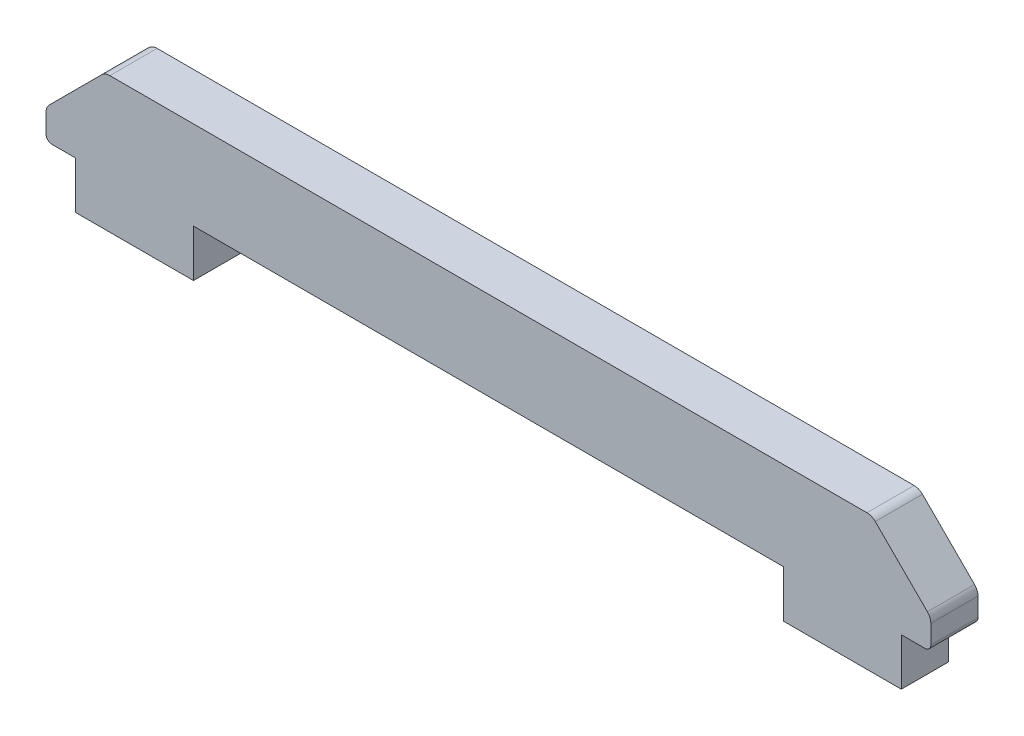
ISO-10303-21;
HEADER;
FILE_DESCRIPTION(('STEP AP214'),'2;1');
FILE_NAME('part.step','',(''),(''),'','','');
FILE_SCHEMA(('AUTOMOTIVE_DESIGN { 1 0 10303 214 1 1 1 1 }'));
ENDSEC;
DATA;
#1=APPLICATION_CONTEXT('core data for automotive mechanical design processes');
#2=APPLICATION_PROTOCOL_DEFINITION('international standard','automotive_design',2000,#1);
#3=PRODUCT_CONTEXT('',#1,'mechanical');
#4=PRODUCT('Part','Part','',(#3));
#5=PRODUCT_RELATED_PRODUCT_CATEGORY('part','',(#4));
#6=PRODUCT_DEFINITION_FORMATION('','',#4);
#7=PRODUCT_DEFINITION_CONTEXT('part definition',#1,'design');
#8=PRODUCT_DEFINITION('design','',#6,#7);
#9=PRODUCT_DEFINITION_SHAPE('','',#8);
#10=(LENGTH_UNIT() NAMED_UNIT(*) SI_UNIT(.MILLI.,.METRE.));
#11=(NAMED_UNIT(*) PLANE_ANGLE_UNIT() SI_UNIT($,.RADIAN.));
#12=(NAMED_UNIT(*) SI_UNIT($,.STERADIAN.) SOLID_ANGLE_UNIT());
#13=UNCERTAINTY_MEASURE_WITH_UNIT(LENGTH_MEASURE(1.E-05),#10,'distance_accuracy_value','');
#14=(GEOMETRIC_REPRESENTATION_CONTEXT(3) GLOBAL_UNCERTAINTY_ASSIGNED_CONTEXT((#13)) GLOBAL_UNIT_ASSIGNED_CONTEXT((#10,
#11,#12)) REPRESENTATION_CONTEXT('',''));
#15=CARTESIAN_POINT('',(0.,0.,0.));
#16=DIRECTION('',(0.,0.,1.));
#17=DIRECTION('',(1.,0.,0.));
#18=AXIS2_PLACEMENT_3D('',#15,#16,#17);
#19=CARTESIAN_POINT('',(2.,-10.8284271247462,8.));
#20=DIRECTION('',(0.,0.,-1.));
#21=DIRECTION('',(-1.,0.,0.));
#22=AXIS2_PLACEMENT_3D('',#19,#20,#21);
#23=CYLINDRICAL_SURFACE('',#22,2.);
#24=CARTESIAN_POINT('',(2.,-10.8284271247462,0.));
#25=DIRECTION('',(0.,0.,1.));
#26=DIRECTION('',(1.,0.,0.));
#27=AXIS2_PLACEMENT_3D('',#24,#25,#26);
#28=CIRCLE('',#27,2.);
#29=CARTESIAN_POINT('',(0.585786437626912,-9.41421356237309,0.));
#30=VERTEX_POINT('',#29);
#31=CARTESIAN_POINT('',(0.,-10.8284271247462,0.));
#32=VERTEX_POINT('',#31);
#33=EDGE_CURVE('E201',#30,#32,#28,.T.);
#34=ORIENTED_EDGE('',*,*,#33,.T.);
#35=DIRECTION('',(0.,0.,-1.));
#36=VECTOR('',#35,1.);
#37=CARTESIAN_POINT('',(0.,-10.8284271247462,8.));
#38=LINE('',#37,#36);
#39=CARTESIAN_POINT('',(0.,-10.8284271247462,8.));
#40=VERTEX_POINT('',#39);
#41=EDGE_CURVE('E11',#40,#32,#38,.T.);
#42=ORIENTED_EDGE('',*,*,#41,.F.);
#43=CARTESIAN_POINT('',(2.,-10.8284271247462,8.));
#44=DIRECTION('',(0.,0.,1.));
#45=DIRECTION('',(1.,0.,0.));
#46=AXIS2_PLACEMENT_3D('',#43,#44,#45);
#47=CIRCLE('',#46,2.);
#48=CARTESIAN_POINT('',(0.585786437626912,-9.41421356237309,8.));
#49=VERTEX_POINT('',#48);
#50=EDGE_CURVE('E239',#49,#40,#47,.T.);
#51=ORIENTED_EDGE('',*,*,#50,.F.);
#52=DIRECTION('',(0.,0.,-1.));
#53=VECTOR('',#52,1.);
#54=CARTESIAN_POINT('',(0.585786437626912,-9.41421356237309,8.));
#55=LINE('',#54,#53);
#56=EDGE_CURVE('E197',#49,#30,#55,.T.);
#57=ORIENTED_EDGE('',*,*,#56,.T.);
#58=EDGE_LOOP('',(#34,#42,#51,#57));
#59=FACE_BOUND('',#58,.T.);
#60=ADVANCED_FACE('F33',(#59),#23,.T.);
#61=CARTESIAN_POINT('',(0.,-10.8284271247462,8.));
#62=DIRECTION('',(1.,0.,0.));
#63=DIRECTION('',(0.,1.,0.));
#64=AXIS2_PLACEMENT_3D('',#61,#62,#63);
#65=PLANE('',#64);
#66=DIRECTION('',(0.,-1.,0.));
#67=VECTOR('',#66,1.);
#68=CARTESIAN_POINT('',(0.,-10.8284271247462,0.));
#69=LINE('',#68,#67);
#70=CARTESIAN_POINT('',(0.,-14.,0.));
#71=VERTEX_POINT('',#70);
#72=EDGE_CURVE('E204',#32,#71,#69,.T.);
#73=ORIENTED_EDGE('',*,*,#72,.T.);
#74=DIRECTION('',(0.,0.,-1.));
#75=VECTOR('',#74,1.);
#76=CARTESIAN_POINT('',(0.,-14.,8.));
#77=LINE('',#76,#75);
#78=CARTESIAN_POINT('',(0.,-14.,8.));
#79=VERTEX_POINT('',#78);
#80=EDGE_CURVE('E41',#79,#71,#77,.T.);
#81=ORIENTED_EDGE('',*,*,#80,.F.);
#82=DIRECTION('',(0.,-1.,0.));
#83=VECTOR('',#82,1.);
#84=CARTESIAN_POINT('',(0.,-10.8284271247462,8.));
#85=LINE('',#84,#83);
#86=EDGE_CURVE('E128',#40,#79,#85,.T.);
#87=ORIENTED_EDGE('',*,*,#86,.F.);
#88=ORIENTED_EDGE('',*,*,#41,.T.);
#89=EDGE_LOOP('',(#73,#81,#87,#88));
#90=FACE_BOUND('',#89,.T.);
#91=ADVANCED_FACE('F357',(#90),#65,.F.);
#92=CARTESIAN_POINT('',(1.,-14.,8.));
#93=DIRECTION('',(0.,0.,-1.));
#94=DIRECTION('',(-1.,0.,0.));
#95=AXIS2_PLACEMENT_3D('',#92,#93,#94);
#96=CYLINDRICAL_SURFACE('',#95,1.);
#97=CARTESIAN_POINT('',(1.,-14.,0.));
#98=DIRECTION('',(0.,0.,1.));
#99=DIRECTION('',(-1.,0.,0.));
#100=AXIS2_PLACEMENT_3D('',#97,#98,#99);
#101=CIRCLE('',#100,1.);
#102=CARTESIAN_POINT('',(1.00000000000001,-15.,0.));
#103=VERTEX_POINT('',#102);
#104=EDGE_CURVE('E206',#71,#103,#101,.T.);
#105=ORIENTED_EDGE('',*,*,#104,.T.);
#106=DIRECTION('',(0.,0.,-1.));
#107=VECTOR('',#106,1.);
#108=CARTESIAN_POINT('',(1.00000000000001,-15.,8.));
#109=LINE('',#108,#107);
#110=CARTESIAN_POINT('',(1.00000000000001,-15.,8.));
#111=VERTEX_POINT('',#110);
#112=EDGE_CURVE('E282',#111,#103,#109,.T.);
#113=ORIENTED_EDGE('',*,*,#112,.F.);
#114=CARTESIAN_POINT('',(1.,-14.,8.));
#115=DIRECTION('',(0.,0.,1.));
#116=DIRECTION('',(-1.,0.,0.));
#117=AXIS2_PLACEMENT_3D('',#114,#115,#116);
#118=CIRCLE('',#117,1.);
#119=EDGE_CURVE('E290',#79,#111,#118,.T.);
#120=ORIENTED_EDGE('',*,*,#119,.F.);
#121=ORIENTED_EDGE('',*,*,#80,.T.);
#122=EDGE_LOOP('',(#105,#113,#120,#121));
#123=FACE_BOUND('',#122,.T.);
#124=ADVANCED_FACE('F288',(#123),#96,.T.);
#125=CARTESIAN_POINT('',(1.00000000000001,-15.,8.));
#126=DIRECTION('',(0.,1.,0.));
#127=DIRECTION('',(-1.,0.,0.));
#128=AXIS2_PLACEMENT_3D('',#125,#126,#127);
#129=PLANE('',#128);
#130=DIRECTION('',(1.,0.,0.));
#131=VECTOR('',#130,1.);
#132=CARTESIAN_POINT('',(1.00000000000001,-15.,0.));
#133=LINE('',#132,#131);
#134=CARTESIAN_POINT('',(4.99999999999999,-15.,0.));
#135=VERTEX_POINT('',#134);
#136=EDGE_CURVE('E208',#103,#135,#133,.T.);
#137=ORIENTED_EDGE('',*,*,#136,.T.);
#138=DIRECTION('',(0.,0.,-1.));
#139=VECTOR('',#138,1.);
#140=CARTESIAN_POINT('',(4.99999999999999,-15.,8.));
#141=LINE('',#140,#139);
#142=CARTESIAN_POINT('',(4.99999999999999,-15.,8.));
#143=VERTEX_POINT('',#142);
#144=EDGE_CURVE('E279',#143,#135,#141,.T.);
#145=ORIENTED_EDGE('',*,*,#144,.F.);
#146=DIRECTION('',(1.,0.,0.));
#147=VECTOR('',#146,1.);
#148=CARTESIAN_POINT('',(1.00000000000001,-15.,8.));
#149=LINE('',#148,#147);
#150=EDGE_CURVE('E308',#111,#143,#149,.T.);
#151=ORIENTED_EDGE('',*,*,#150,.F.);
#152=ORIENTED_EDGE('',*,*,#112,.T.);
#153=EDGE_LOOP('',(#137,#145,#151,#152));
#154=FACE_BOUND('',#153,.T.);
#155=ADVANCED_FACE('F299',(#154),#129,.F.);
#156=CARTESIAN_POINT('',(4.99999999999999,-15.,8.));
#157=DIRECTION('',(1.,0.,0.));
#158=DIRECTION('',(0.,0.,-1.));
#159=AXIS2_PLACEMENT_3D('',#156,#157,#158);
#160=PLANE('',#159);
#161=DIRECTION('',(0.,-1.,0.));
#162=VECTOR('',#161,1.);
#163=CARTESIAN_POINT('',(4.99999999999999,-15.,0.));
#164=LINE('',#163,#162);
#165=CARTESIAN_POINT('',(4.99999999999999,-23.,0.));
#166=VERTEX_POINT('',#165);
#167=EDGE_CURVE('E210',#135,#166,#164,.T.);
#168=ORIENTED_EDGE('',*,*,#167,.T.);
#169=DIRECTION('',(0.,0.,-1.));
#170=VECTOR('',#169,1.);
#171=CARTESIAN_POINT('',(4.99999999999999,-23.,8.));
#172=LINE('',#171,#170);
#173=CARTESIAN_POINT('',(4.99999999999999,-23.,8.));
#174=VERTEX_POINT('',#173);
#175=EDGE_CURVE('E276',#174,#166,#172,.T.);
#176=ORIENTED_EDGE('',*,*,#175,.F.);
#177=DIRECTION('',(0.,-1.,0.));
#178=VECTOR('',#177,1.);
#179=CARTESIAN_POINT('',(4.99999999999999,-15.,8.));
#180=LINE('',#179,#178);
#181=EDGE_CURVE('E305',#143,#174,#180,.T.);
#182=ORIENTED_EDGE('',*,*,#181,.F.);
#183=ORIENTED_EDGE('',*,*,#144,.T.);
#184=EDGE_LOOP('',(#168,#176,#182,#183));
#185=FACE_BOUND('',#184,.T.);
#186=ADVANCED_FACE('F303',(#185),#160,.F.);
#187=CARTESIAN_POINT('',(25.,-23.,8.));
#188=DIRECTION('',(0.,1.,0.));
#189=DIRECTION('',(-1.,0.,0.));
#190=AXIS2_PLACEMENT_3D('',#187,#188,#189);
#191=PLANE('',#190);
#192=DIRECTION('',(1.,0.,0.));
#193=VECTOR('',#192,1.);
#194=CARTESIAN_POINT('',(25.,-23.,0.));
#195=LINE('',#194,#193);
#196=CARTESIAN_POINT('',(25.,-23.,0.));
#197=VERTEX_POINT('',#196);
#198=EDGE_CURVE('E212',#166,#197,#195,.T.);
#199=ORIENTED_EDGE('',*,*,#198,.T.);
#200=DIRECTION('',(0.,0.,-1.));
#201=VECTOR('',#200,1.);
#202=CARTESIAN_POINT('',(25.,-23.,8.));
#203=LINE('',#202,#201);
#204=CARTESIAN_POINT('',(25.,-23.,8.));
#205=VERTEX_POINT('',#204);
#206=EDGE_CURVE('E273',#205,#197,#203,.T.);
#207=ORIENTED_EDGE('',*,*,#206,.F.);
#208=DIRECTION('',(1.,0.,0.));
#209=VECTOR('',#208,1.);
#210=CARTESIAN_POINT('',(25.,-23.,8.));
#211=LINE('',#210,#209);
#212=EDGE_CURVE('E307',#174,#205,#211,.T.);
#213=ORIENTED_EDGE('',*,*,#212,.F.);
#214=ORIENTED_EDGE('',*,*,#175,.T.);
#215=EDGE_LOOP('',(#199,#207,#213,#214));
#216=FACE_BOUND('',#215,.T.);
#217=ADVANCED_FACE('F370',(#216),#191,.F.);
#218=CARTESIAN_POINT('',(25.,-15.,8.));
#219=DIRECTION('',(-1.,0.,0.));
#220=DIRECTION('',(0.,0.,1.));
#221=AXIS2_PLACEMENT_3D('',#218,#219,#220);
#222=PLANE('',#221);
#223=DIRECTION('',(0.,1.,0.));
#224=VECTOR('',#223,1.);
#225=CARTESIAN_POINT('',(25.,-15.,0.));
#226=LINE('',#225,#224);
#227=CARTESIAN_POINT('',(25.,-15.,0.));
#228=VERTEX_POINT('',#227);
#229=EDGE_CURVE('E214',#197,#228,#226,.T.);
#230=ORIENTED_EDGE('',*,*,#229,.T.);
#231=DIRECTION('',(0.,0.,-1.));
#232=VECTOR('',#231,1.);
#233=CARTESIAN_POINT('',(25.,-15.,8.));
#234=LINE('',#233,#232);
#235=CARTESIAN_POINT('',(25.,-15.,8.));
#236=VERTEX_POINT('',#235);
#237=EDGE_CURVE('E270',#236,#228,#234,.T.);
#238=ORIENTED_EDGE('',*,*,#237,.F.);
#239=DIRECTION('',(0.,1.,0.));
#240=VECTOR('',#239,1.);
#241=CARTESIAN_POINT('',(25.,-15.,8.));
#242=LINE('',#241,#240);
#243=EDGE_CURVE('E310',#205,#236,#242,.T.);
#244=ORIENTED_EDGE('',*,*,#243,.F.);
#245=ORIENTED_EDGE('',*,*,#206,.T.);
#246=EDGE_LOOP('',(#230,#238,#244,#245));
#247=FACE_BOUND('',#246,.T.);
#248=ADVANCED_FACE('F373',(#247),#222,.F.);
#249=CARTESIAN_POINT('',(25.,-15.,8.));
#250=DIRECTION('',(0.,1.,0.));
#251=DIRECTION('',(-1.,0.,0.));
#252=AXIS2_PLACEMENT_3D('',#249,#250,#251);
#253=PLANE('',#252);
#254=DIRECTION('',(1.,0.,0.));
#255=VECTOR('',#254,1.);
#256=CARTESIAN_POINT('',(25.,-15.,0.));
#257=LINE('',#256,#255);
#258=CARTESIAN_POINT('',(125.,-15.,0.));
#259=VERTEX_POINT('',#258);
#260=EDGE_CURVE('E216',#228,#259,#257,.T.);
#261=ORIENTED_EDGE('',*,*,#260,.T.);
#262=DIRECTION('',(0.,0.,-1.));
#263=VECTOR('',#262,1.);
#264=CARTESIAN_POINT('',(125.,-15.,8.));
#265=LINE('',#264,#263);
#266=CARTESIAN_POINT('',(125.,-15.,8.));
#267=VERTEX_POINT('',#266);
#268=EDGE_CURVE('E267',#267,#259,#265,.T.);
#269=ORIENTED_EDGE('',*,*,#268,.F.);
#270=DIRECTION('',(1.,0.,0.));
#271=VECTOR('',#270,1.);
#272=CARTESIAN_POINT('',(25.,-15.,8.));
#273=LINE('',#272,#271);
#274=EDGE_CURVE('E316',#236,#267,#273,.T.);
#275=ORIENTED_EDGE('',*,*,#274,.F.);
#276=ORIENTED_EDGE('',*,*,#237,.T.);
#277=EDGE_LOOP('',(#261,#269,#275,#276));
#278=FACE_BOUND('',#277,.T.);
#279=ADVANCED_FACE('F377',(#278),#253,.F.);
#280=CARTESIAN_POINT('',(125.,-15.,8.));
#281=DIRECTION('',(1.,0.,0.));
#282=DIRECTION('',(0.,0.,-1.));
#283=AXIS2_PLACEMENT_3D('',#280,#281,#282);
#284=PLANE('',#283);
#285=DIRECTION('',(0.,-1.,0.));
#286=VECTOR('',#285,1.);
#287=CARTESIAN_POINT('',(125.,-15.,0.));
#288=LINE('',#287,#286);
#289=CARTESIAN_POINT('',(125.,-23.,0.));
#290=VERTEX_POINT('',#289);
#291=EDGE_CURVE('E218',#259,#290,#288,.T.);
#292=ORIENTED_EDGE('',*,*,#291,.T.);
#293=DIRECTION('',(0.,0.,-1.));
#294=VECTOR('',#293,1.);
#295=CARTESIAN_POINT('',(125.,-23.,8.));
#296=LINE('',#295,#294);
#297=CARTESIAN_POINT('',(125.,-23.,8.));
#298=VERTEX_POINT('',#297);
#299=EDGE_CURVE('E264',#298,#290,#296,.T.);
#300=ORIENTED_EDGE('',*,*,#299,.F.);
#301=DIRECTION('',(0.,-1.,0.));
#302=VECTOR('',#301,1.);
#303=CARTESIAN_POINT('',(125.,-15.,8.));
#304=LINE('',#303,#302);
#305=EDGE_CURVE('E318',#267,#298,#304,.T.);
#306=ORIENTED_EDGE('',*,*,#305,.F.);
#307=ORIENTED_EDGE('',*,*,#268,.T.);
#308=EDGE_LOOP('',(#292,#300,#306,#307));
#309=FACE_BOUND('',#308,.T.);
#310=ADVANCED_FACE('F381',(#309),#284,.F.);
#311=CARTESIAN_POINT('',(145.,-23.,8.));
#312=DIRECTION('',(0.,1.,0.));
#313=DIRECTION('',(-1.,0.,0.));
#314=AXIS2_PLACEMENT_3D('',#311,#312,#313);
#315=PLANE('',#314);
#316=DIRECTION('',(1.,0.,0.));
#317=VECTOR('',#316,1.);
#318=CARTESIAN_POINT('',(145.,-23.,0.));
#319=LINE('',#318,#317);
#320=CARTESIAN_POINT('',(145.,-23.,0.));
#321=VERTEX_POINT('',#320);
#322=EDGE_CURVE('E220',#290,#321,#319,.T.);
#323=ORIENTED_EDGE('',*,*,#322,.T.);
#324=DIRECTION('',(0.,0.,-1.));
#325=VECTOR('',#324,1.);
#326=CARTESIAN_POINT('',(145.,-23.,8.));
#327=LINE('',#326,#325);
#328=CARTESIAN_POINT('',(145.,-23.,8.));
#329=VERTEX_POINT('',#328);
#330=EDGE_CURVE('E261',#329,#321,#327,.T.);
#331=ORIENTED_EDGE('',*,*,#330,.F.);
#332=DIRECTION('',(1.,0.,0.));
#333=VECTOR('',#332,1.);
#334=CARTESIAN_POINT('',(145.,-23.,8.));
#335=LINE('',#334,#333);
#336=EDGE_CURVE('E320',#298,#329,#335,.T.);
#337=ORIENTED_EDGE('',*,*,#336,.F.);
#338=ORIENTED_EDGE('',*,*,#299,.T.);
#339=EDGE_LOOP('',(#323,#331,#337,#338));
#340=FACE_BOUND('',#339,.T.);
#341=ADVANCED_FACE('F385',(#340),#315,.F.);
#342=CARTESIAN_POINT('',(145.,-15.,8.));
#343=DIRECTION('',(-1.,0.,0.));
#344=DIRECTION('',(0.,0.,1.));
#345=AXIS2_PLACEMENT_3D('',#342,#343,#344);
#346=PLANE('',#345);
#347=DIRECTION('',(0.,1.,0.));
#348=VECTOR('',#347,1.);
#349=CARTESIAN_POINT('',(145.,-15.,0.));
#350=LINE('',#349,#348);
#351=CARTESIAN_POINT('',(145.,-15.,0.));
#352=VERTEX_POINT('',#351);
#353=EDGE_CURVE('E222',#321,#352,#350,.T.);
#354=ORIENTED_EDGE('',*,*,#353,.T.);
#355=DIRECTION('',(0.,0.,-1.));
#356=VECTOR('',#355,1.);
#357=CARTESIAN_POINT('',(145.,-15.,8.));
#358=LINE('',#357,#356);
#359=CARTESIAN_POINT('',(145.,-15.,8.));
#360=VERTEX_POINT('',#359);
#361=EDGE_CURVE('E258',#360,#352,#358,.T.);
#362=ORIENTED_EDGE('',*,*,#361,.F.);
#363=DIRECTION('',(0.,1.,0.));
#364=VECTOR('',#363,1.);
#365=CARTESIAN_POINT('',(145.,-15.,8.));
#366=LINE('',#365,#364);
#367=EDGE_CURVE('E322',#329,#360,#366,.T.);
#368=ORIENTED_EDGE('',*,*,#367,.F.);
#369=ORIENTED_EDGE('',*,*,#330,.T.);
#370=EDGE_LOOP('',(#354,#362,#368,#369));
#371=FACE_BOUND('',#370,.T.);
#372=ADVANCED_FACE('F389',(#371),#346,.F.);
#373=CARTESIAN_POINT('',(145.,-15.,8.));
#374=DIRECTION('',(0.,1.,0.));
#375=DIRECTION('',(-1.,0.,0.));
#376=AXIS2_PLACEMENT_3D('',#373,#374,#375);
#377=PLANE('',#376);
#378=DIRECTION('',(1.,0.,0.));
#379=VECTOR('',#378,1.);
#380=CARTESIAN_POINT('',(145.,-15.,0.));
#381=LINE('',#380,#379);
#382=CARTESIAN_POINT('',(149.,-15.,0.));
#383=VERTEX_POINT('',#382);
#384=EDGE_CURVE('E224',#352,#383,#381,.T.);
#385=ORIENTED_EDGE('',*,*,#384,.T.);
#386=DIRECTION('',(0.,0.,-1.));
#387=VECTOR('',#386,1.);
#388=CARTESIAN_POINT('',(149.,-15.,8.));
#389=LINE('',#388,#387);
#390=CARTESIAN_POINT('',(149.,-15.,8.));
#391=VERTEX_POINT('',#390);
#392=EDGE_CURVE('E255',#391,#383,#389,.T.);
#393=ORIENTED_EDGE('',*,*,#392,.F.);
#394=DIRECTION('',(1.,0.,0.));
#395=VECTOR('',#394,1.);
#396=CARTESIAN_POINT('',(145.,-15.,8.));
#397=LINE('',#396,#395);
#398=EDGE_CURVE('E324',#360,#391,#397,.T.);
#399=ORIENTED_EDGE('',*,*,#398,.F.);
#400=ORIENTED_EDGE('',*,*,#361,.T.);
#401=EDGE_LOOP('',(#385,#393,#399,#400));
#402=FACE_BOUND('',#401,.T.);
#403=ADVANCED_FACE('F393',(#402),#377,.F.);
#404=CARTESIAN_POINT('',(149.,-14.,8.));
#405=DIRECTION('',(0.,0.,-1.));
#406=DIRECTION('',(-1.,0.,0.));
#407=AXIS2_PLACEMENT_3D('',#404,#405,#406);
#408=CYLINDRICAL_SURFACE('',#407,1.);
#409=CARTESIAN_POINT('',(149.,-14.,0.));
#410=DIRECTION('',(0.,0.,1.));
#411=DIRECTION('',(1.,0.,0.));
#412=AXIS2_PLACEMENT_3D('',#409,#410,#411);
#413=CIRCLE('',#412,1.);
#414=CARTESIAN_POINT('',(150.,-14.,0.));
#415=VERTEX_POINT('',#414);
#416=EDGE_CURVE('E226',#383,#415,#413,.T.);
#417=ORIENTED_EDGE('',*,*,#416,.T.);
#418=DIRECTION('',(0.,0.,-1.));
#419=VECTOR('',#418,1.);
#420=CARTESIAN_POINT('',(150.,-14.,8.));
#421=LINE('',#420,#419);
#422=CARTESIAN_POINT('',(150.,-14.,8.));
#423=VERTEX_POINT('',#422);
#424=EDGE_CURVE('E252',#423,#415,#421,.T.);
#425=ORIENTED_EDGE('',*,*,#424,.F.);
#426=CARTESIAN_POINT('',(149.,-14.,8.));
#427=DIRECTION('',(0.,0.,1.));
#428=DIRECTION('',(1.,0.,0.));
#429=AXIS2_PLACEMENT_3D('',#426,#427,#428);
#430=CIRCLE('',#429,1.);
#431=EDGE_CURVE('E326',#391,#423,#430,.T.);
#432=ORIENTED_EDGE('',*,*,#431,.F.);
#433=ORIENTED_EDGE('',*,*,#392,.T.);
#434=EDGE_LOOP('',(#417,#425,#432,#433));
#435=FACE_BOUND('',#434,.T.);
#436=ADVANCED_FACE('F397',(#435),#408,.T.);
#437=CARTESIAN_POINT('',(150.,-10.8284271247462,8.));
#438=DIRECTION('',(-1.,0.,0.));
#439=DIRECTION('',(0.,-1.,0.));
#440=AXIS2_PLACEMENT_3D('',#437,#438,#439);
#441=PLANE('',#440);
#442=DIRECTION('',(0.,1.,0.));
#443=VECTOR('',#442,1.);
#444=CARTESIAN_POINT('',(150.,-10.8284271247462,0.));
#445=LINE('',#444,#443);
#446=CARTESIAN_POINT('',(150.,-10.8284271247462,0.));
#447=VERTEX_POINT('',#446);
#448=EDGE_CURVE('E228',#415,#447,#445,.T.);
#449=ORIENTED_EDGE('',*,*,#448,.T.);
#450=DIRECTION('',(0.,0.,-1.));
#451=VECTOR('',#450,1.);
#452=CARTESIAN_POINT('',(150.,-10.8284271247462,8.));
#453=LINE('',#452,#451);
#454=CARTESIAN_POINT('',(150.,-10.8284271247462,8.));
#455=VERTEX_POINT('',#454);
#456=EDGE_CURVE('E249',#455,#447,#453,.T.);
#457=ORIENTED_EDGE('',*,*,#456,.F.);
#458=DIRECTION('',(0.,1.,0.));
#459=VECTOR('',#458,1.);
#460=CARTESIAN_POINT('',(150.,-10.8284271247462,8.));
#461=LINE('',#460,#459);
#462=EDGE_CURVE('E328',#423,#455,#461,.T.);
#463=ORIENTED_EDGE('',*,*,#462,.F.);
#464=ORIENTED_EDGE('',*,*,#424,.T.);
#465=EDGE_LOOP('',(#449,#457,#463,#464));
#466=FACE_BOUND('',#465,.T.);
#467=ADVANCED_FACE('F401',(#466),#441,.F.);
#468=CARTESIAN_POINT('',(148.,-10.8284271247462,8.));
#469=DIRECTION('',(0.,0.,-1.));
#470=DIRECTION('',(-1.,0.,0.));
#471=AXIS2_PLACEMENT_3D('',#468,#469,#470);
#472=CYLINDRICAL_SURFACE('',#471,2.00000000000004);
#473=CARTESIAN_POINT('',(148.,-10.8284271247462,0.));
#474=DIRECTION('',(0.,0.,1.));
#475=DIRECTION('',(-1.,0.,0.));
#476=AXIS2_PLACEMENT_3D('',#473,#474,#475);
#477=CIRCLE('',#476,2.00000000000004);
#478=CARTESIAN_POINT('',(149.414213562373,-9.41421356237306,0.));
#479=VERTEX_POINT('',#478);
#480=EDGE_CURVE('E230',#447,#479,#477,.T.);
#481=ORIENTED_EDGE('',*,*,#480,.T.);
#482=DIRECTION('',(0.,0.,-1.));
#483=VECTOR('',#482,1.);
#484=CARTESIAN_POINT('',(149.414213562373,-9.41421356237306,8.));
#485=LINE('',#484,#483);
#486=CARTESIAN_POINT('',(149.414213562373,-9.41421356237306,8.));
#487=VERTEX_POINT('',#486);
#488=EDGE_CURVE('E246',#487,#479,#485,.T.);
#489=ORIENTED_EDGE('',*,*,#488,.F.);
#490=CARTESIAN_POINT('',(148.,-10.8284271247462,8.));
#491=DIRECTION('',(0.,0.,1.));
#492=DIRECTION('',(-1.,0.,0.));
#493=AXIS2_PLACEMENT_3D('',#490,#491,#492);
#494=CIRCLE('',#493,2.00000000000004);
#495=EDGE_CURVE('E330',#455,#487,#494,.T.);
#496=ORIENTED_EDGE('',*,*,#495,.F.);
#497=ORIENTED_EDGE('',*,*,#456,.T.);
#498=EDGE_LOOP('',(#481,#489,#496,#497));
#499=FACE_BOUND('',#498,.T.);
#500=ADVANCED_FACE('F405',(#499),#472,.T.);
#501=CARTESIAN_POINT('',(140.585786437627,-0.585786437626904,8.));
#502=DIRECTION('',(-0.707106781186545,-0.70710678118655,0.));
#503=DIRECTION('',(0.70710678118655,-0.707106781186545,0.));
#504=AXIS2_PLACEMENT_3D('',#501,#502,#503);
#505=PLANE('',#504);
#506=DIRECTION('',(-0.70710678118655,0.707106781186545,0.));
#507=VECTOR('',#506,1.);
#508=CARTESIAN_POINT('',(140.585786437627,-0.585786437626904,0.));
#509=LINE('',#508,#507);
#510=CARTESIAN_POINT('',(140.585786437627,-0.585786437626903,0.));
#511=VERTEX_POINT('',#510);
#512=EDGE_CURVE('E232',#479,#511,#509,.T.);
#513=ORIENTED_EDGE('',*,*,#512,.T.);
#514=DIRECTION('',(0.,0.,-1.));
#515=VECTOR('',#514,1.);
#516=CARTESIAN_POINT('',(140.585786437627,-0.585786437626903,8.));
#517=LINE('',#516,#515);
#518=CARTESIAN_POINT('',(140.585786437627,-0.585786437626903,8.));
#519=VERTEX_POINT('',#518);
#520=EDGE_CURVE('E243',#519,#511,#517,.T.);
#521=ORIENTED_EDGE('',*,*,#520,.F.);
#522=DIRECTION('',(-0.70710678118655,0.707106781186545,0.));
#523=VECTOR('',#522,1.);
#524=CARTESIAN_POINT('',(140.585786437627,-0.585786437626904,8.));
#525=LINE('',#524,#523);
#526=EDGE_CURVE('E332',#487,#519,#525,.T.);
#527=ORIENTED_EDGE('',*,*,#526,.F.);
#528=ORIENTED_EDGE('',*,*,#488,.T.);
#529=EDGE_LOOP('',(#513,#521,#527,#528));
#530=FACE_BOUND('',#529,.T.);
#531=ADVANCED_FACE('F338',(#530),#505,.F.);
#532=CARTESIAN_POINT('',(139.171572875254,-2.,8.));
#533=DIRECTION('',(0.,0.,-1.));
#534=DIRECTION('',(-1.,0.,0.));
#535=AXIS2_PLACEMENT_3D('',#532,#533,#534);
#536=CYLINDRICAL_SURFACE('',#535,2.);
#537=CARTESIAN_POINT('',(139.171572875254,-2.,0.));
#538=DIRECTION('',(0.,0.,1.));
#539=DIRECTION('',(-1.,0.,0.));
#540=AXIS2_PLACEMENT_3D('',#537,#538,#539);
#541=CIRCLE('',#540,2.);
#542=CARTESIAN_POINT('',(139.171572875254,0.,0.));
#543=VERTEX_POINT('',#542);
#544=EDGE_CURVE('E234',#511,#543,#541,.T.);
#545=ORIENTED_EDGE('',*,*,#544,.T.);
#546=DIRECTION('',(0.,0.,-1.));
#547=VECTOR('',#546,1.);
#548=CARTESIAN_POINT('',(139.171572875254,0.,8.));
#549=LINE('',#548,#547);
#550=CARTESIAN_POINT('',(139.171572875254,0.,8.));
#551=VERTEX_POINT('',#550);
#552=EDGE_CURVE('E192',#551,#543,#549,.T.);
#553=ORIENTED_EDGE('',*,*,#552,.F.);
#554=CARTESIAN_POINT('',(139.171572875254,-2.,8.));
#555=DIRECTION('',(0.,0.,1.));
#556=DIRECTION('',(-1.,0.,0.));
#557=AXIS2_PLACEMENT_3D('',#554,#555,#556);
#558=CIRCLE('',#557,2.);
#559=EDGE_CURVE('E183',#519,#551,#558,.T.);
#560=ORIENTED_EDGE('',*,*,#559,.F.);
#561=ORIENTED_EDGE('',*,*,#520,.T.);
#562=EDGE_LOOP('',(#545,#553,#560,#561));
#563=FACE_BOUND('',#562,.T.);
#564=ADVANCED_FACE('F342',(#563),#536,.T.);
#565=CARTESIAN_POINT('',(10.8284271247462,0.,8.));
#566=DIRECTION('',(0.,-1.,0.));
#567=DIRECTION('',(0.,0.,-1.));
#568=AXIS2_PLACEMENT_3D('',#565,#566,#567);
#569=PLANE('',#568);
#570=DIRECTION('',(-1.,0.,0.));
#571=VECTOR('',#570,1.);
#572=CARTESIAN_POINT('',(10.8284271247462,0.,0.));
#573=LINE('',#572,#571);
#574=CARTESIAN_POINT('',(10.8284271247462,0.,0.));
#575=VERTEX_POINT('',#574);
#576=EDGE_CURVE('E191',#543,#575,#573,.T.);
#577=ORIENTED_EDGE('',*,*,#576,.T.);
#578=DIRECTION('',(0.,0.,-1.));
#579=VECTOR('',#578,1.);
#580=CARTESIAN_POINT('',(10.8284271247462,0.,8.));
#581=LINE('',#580,#579);
#582=CARTESIAN_POINT('',(10.8284271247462,0.,8.));
#583=VERTEX_POINT('',#582);
#584=EDGE_CURVE('E188',#583,#575,#581,.T.);
#585=ORIENTED_EDGE('',*,*,#584,.F.);
#586=DIRECTION('',(-1.,0.,0.));
#587=VECTOR('',#586,1.);
#588=CARTESIAN_POINT('',(10.8284271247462,0.,8.));
#589=LINE('',#588,#587);
#590=EDGE_CURVE('E177',#551,#583,#589,.T.);
#591=ORIENTED_EDGE('',*,*,#590,.F.);
#592=ORIENTED_EDGE('',*,*,#552,.T.);
#593=EDGE_LOOP('',(#577,#585,#591,#592));
#594=FACE_BOUND('',#593,.T.);
#595=ADVANCED_FACE('F189',(#594),#569,.F.);
#596=CARTESIAN_POINT('',(10.8284271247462,-2.,8.));
#597=DIRECTION('',(0.,0.,-1.));
#598=DIRECTION('',(-1.,0.,0.));
#599=AXIS2_PLACEMENT_3D('',#596,#597,#598);
#600=CYLINDRICAL_SURFACE('',#599,2.);
#601=CARTESIAN_POINT('',(10.8284271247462,-2.,0.));
#602=DIRECTION('',(0.,0.,1.));
#603=DIRECTION('',(-1.,0.,0.));
#604=AXIS2_PLACEMENT_3D('',#601,#602,#603);
#605=CIRCLE('',#604,2.);
#606=CARTESIAN_POINT('',(9.41421356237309,-0.585786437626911,0.));
#607=VERTEX_POINT('',#606);
#608=EDGE_CURVE('E114',#575,#607,#605,.T.);
#609=ORIENTED_EDGE('',*,*,#608,.T.);
#610=DIRECTION('',(0.,0.,-1.));
#611=VECTOR('',#610,1.);
#612=CARTESIAN_POINT('',(9.41421356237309,-0.585786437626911,8.));
#613=LINE('',#612,#611);
#614=CARTESIAN_POINT('',(9.41421356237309,-0.585786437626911,8.));
#615=VERTEX_POINT('',#614);
#616=EDGE_CURVE('E193',#615,#607,#613,.T.);
#617=ORIENTED_EDGE('',*,*,#616,.F.);
#618=CARTESIAN_POINT('',(10.8284271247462,-2.,8.));
#619=DIRECTION('',(0.,0.,1.));
#620=DIRECTION('',(-1.,0.,0.));
#621=AXIS2_PLACEMENT_3D('',#618,#619,#620);
#622=CIRCLE('',#621,2.);
#623=EDGE_CURVE('E181',#583,#615,#622,.T.);
#624=ORIENTED_EDGE('',*,*,#623,.F.);
#625=ORIENTED_EDGE('',*,*,#584,.T.);
#626=EDGE_LOOP('',(#609,#617,#624,#625));
#627=FACE_BOUND('',#626,.T.);
#628=ADVANCED_FACE('F195',(#627),#600,.T.);
#629=CARTESIAN_POINT('',(0.585786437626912,-9.41421356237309,8.));
#630=DIRECTION('',(0.707106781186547,-0.707106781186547,0.));
#631=DIRECTION('',(0.707106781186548,0.707106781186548,0.));
#632=AXIS2_PLACEMENT_3D('',#629,#630,#631);
#633=PLANE('',#632);
#634=DIRECTION('',(-0.707106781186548,-0.707106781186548,0.));
#635=VECTOR('',#634,1.);
#636=CARTESIAN_POINT('',(0.585786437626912,-9.41421356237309,0.));
#637=LINE('',#636,#635);
#638=EDGE_CURVE('E120',#607,#30,#637,.T.);
#639=ORIENTED_EDGE('',*,*,#638,.T.);
#640=ORIENTED_EDGE('',*,*,#56,.F.);
#641=DIRECTION('',(-0.707106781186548,-0.707106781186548,0.));
#642=VECTOR('',#641,1.);
#643=CARTESIAN_POINT('',(0.585786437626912,-9.41421356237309,8.));
#644=LINE('',#643,#642);
#645=EDGE_CURVE('E49',#615,#49,#644,.T.);
#646=ORIENTED_EDGE('',*,*,#645,.F.);
#647=ORIENTED_EDGE('',*,*,#616,.T.);
#648=EDGE_LOOP('',(#639,#640,#646,#647));
#649=FACE_BOUND('',#648,.T.);
#650=ADVANCED_FACE('F346',(#649),#633,.F.);
#651=CARTESIAN_POINT('',(2.,-10.8284271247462,8.));
#652=DIRECTION('',(0.,0.,1.));
#653=DIRECTION('',(1.,0.,0.));
#654=AXIS2_PLACEMENT_3D('',#651,#652,#653);
#655=PLANE('',#654);
#656=ORIENTED_EDGE('',*,*,#50,.T.);
#657=ORIENTED_EDGE('',*,*,#86,.T.);
#658=ORIENTED_EDGE('',*,*,#119,.T.);
#659=ORIENTED_EDGE('',*,*,#150,.T.);
#660=ORIENTED_EDGE('',*,*,#181,.T.);
#661=ORIENTED_EDGE('',*,*,#212,.T.);
#662=ORIENTED_EDGE('',*,*,#243,.T.);
#663=ORIENTED_EDGE('',*,*,#274,.T.);
#664=ORIENTED_EDGE('',*,*,#305,.T.);
#665=ORIENTED_EDGE('',*,*,#336,.T.);
#666=ORIENTED_EDGE('',*,*,#367,.T.);
#667=ORIENTED_EDGE('',*,*,#398,.T.);
#668=ORIENTED_EDGE('',*,*,#431,.T.);
#669=ORIENTED_EDGE('',*,*,#462,.T.);
#670=ORIENTED_EDGE('',*,*,#495,.T.);
#671=ORIENTED_EDGE('',*,*,#526,.T.);
#672=ORIENTED_EDGE('',*,*,#559,.T.);
#673=ORIENTED_EDGE('',*,*,#590,.T.);
#674=ORIENTED_EDGE('',*,*,#623,.T.);
#675=ORIENTED_EDGE('',*,*,#645,.T.);
#676=EDGE_LOOP('',(#656,#657,#658,#659,#660,#661,#662,#663,#664,#665,#666,#667,#668,#669,#670,
#671,#672,#673,#674,#675));
#677=FACE_BOUND('',#676,.T.);
#678=ADVANCED_FACE('F179',(#677),#655,.T.);
#679=CARTESIAN_POINT('',(2.,-10.8284271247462,0.));
#680=DIRECTION('',(0.,0.,1.));
#681=DIRECTION('',(1.,0.,0.));
#682=AXIS2_PLACEMENT_3D('',#679,#680,#681);
#683=PLANE('',#682);
#684=ORIENTED_EDGE('',*,*,#33,.F.);
#685=ORIENTED_EDGE('',*,*,#638,.F.);
#686=ORIENTED_EDGE('',*,*,#608,.F.);
#687=ORIENTED_EDGE('',*,*,#576,.F.);
#688=ORIENTED_EDGE('',*,*,#544,.F.);
#689=ORIENTED_EDGE('',*,*,#512,.F.);
#690=ORIENTED_EDGE('',*,*,#480,.F.);
#691=ORIENTED_EDGE('',*,*,#448,.F.);
#692=ORIENTED_EDGE('',*,*,#416,.F.);
#693=ORIENTED_EDGE('',*,*,#384,.F.);
#694=ORIENTED_EDGE('',*,*,#353,.F.);
#695=ORIENTED_EDGE('',*,*,#322,.F.);
#696=ORIENTED_EDGE('',*,*,#291,.F.);
#697=ORIENTED_EDGE('',*,*,#260,.F.);
#698=ORIENTED_EDGE('',*,*,#229,.F.);
#699=ORIENTED_EDGE('',*,*,#198,.F.);
#700=ORIENTED_EDGE('',*,*,#167,.F.);
#701=ORIENTED_EDGE('',*,*,#136,.F.);
#702=ORIENTED_EDGE('',*,*,#104,.F.);
#703=ORIENTED_EDGE('',*,*,#72,.F.);
#704=EDGE_LOOP('',(#684,#685,#686,#687,#688,#689,#690,#691,#692,#693,#694,#695,#696,#697,#698,
#699,#700,#701,#702,#703));
#705=FACE_BOUND('',#704,.T.);
#706=ADVANCED_FACE('F294',(#705),#683,.F.);
#707=CLOSED_SHELL('',(#60,#91,#124,#155,#186,#217,#248,#279,#310,#341,#372,#403,#436,#467,#500,
#531,#564,#595,#628,#650,#678,#706));
#708=MANIFOLD_SOLID_BREP('B2',#707);
#709=ADVANCED_BREP_SHAPE_REPRESENTATION('',(#18,#708),#14);
#710=SHAPE_DEFINITION_REPRESENTATION(#9,#709);
ENDSEC;
END-ISO-10303-21;
